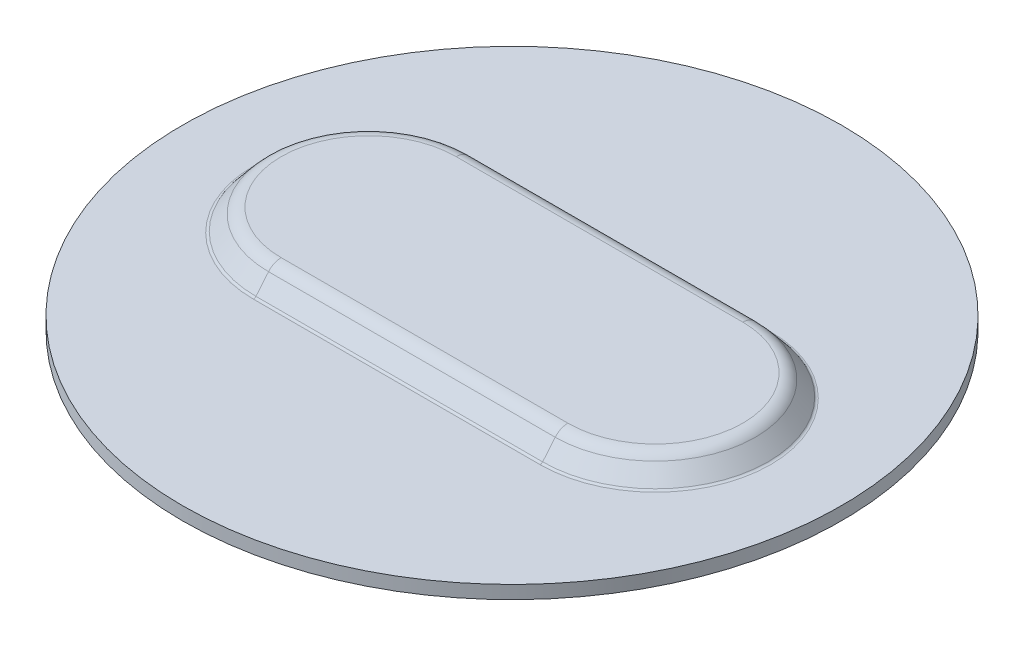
ISO-10303-21;
HEADER;
FILE_DESCRIPTION(('STEP AP214'),'2;1');
FILE_NAME('part.step','',(''),(''),'','','');
FILE_SCHEMA(('AUTOMOTIVE_DESIGN { 1 0 10303 214 1 1 1 1 }'));
ENDSEC;
DATA;
#1=APPLICATION_CONTEXT('core data for automotive mechanical design processes');
#2=APPLICATION_PROTOCOL_DEFINITION('international standard','automotive_design',2000,#1);
#3=PRODUCT_CONTEXT('',#1,'mechanical');
#4=PRODUCT('Part','Part','',(#3));
#5=PRODUCT_RELATED_PRODUCT_CATEGORY('part','',(#4));
#6=PRODUCT_DEFINITION_FORMATION('','',#4);
#7=PRODUCT_DEFINITION_CONTEXT('part definition',#1,'design');
#8=PRODUCT_DEFINITION('design','',#6,#7);
#9=PRODUCT_DEFINITION_SHAPE('','',#8);
#10=(LENGTH_UNIT() NAMED_UNIT(*) SI_UNIT(.MILLI.,.METRE.));
#11=(NAMED_UNIT(*) PLANE_ANGLE_UNIT() SI_UNIT($,.RADIAN.));
#12=(NAMED_UNIT(*) SI_UNIT($,.STERADIAN.) SOLID_ANGLE_UNIT());
#13=UNCERTAINTY_MEASURE_WITH_UNIT(LENGTH_MEASURE(1.E-05),#10,'distance_accuracy_value','');
#14=(GEOMETRIC_REPRESENTATION_CONTEXT(3) GLOBAL_UNCERTAINTY_ASSIGNED_CONTEXT((#13)) GLOBAL_UNIT_ASSIGNED_CONTEXT((#10,
#11,#12)) REPRESENTATION_CONTEXT('',''));
#15=CARTESIAN_POINT('',(0.,0.,0.));
#16=DIRECTION('',(0.,0.,1.));
#17=DIRECTION('',(1.,0.,0.));
#18=AXIS2_PLACEMENT_3D('',#15,#16,#17);
#19=CARTESIAN_POINT('',(-11.049,1.7018,0.));
#20=DIRECTION('',(0.,1.,0.));
#21=DIRECTION('',(0.,0.,1.));
#22=AXIS2_PLACEMENT_3D('',#19,#20,#21);
#23=PLANE('',#22);
#24=CARTESIAN_POINT('',(-11.049,1.7018,0.));
#25=DIRECTION('',(0.,-1.,0.));
#26=DIRECTION('',(0.,0.,1.));
#27=AXIS2_PLACEMENT_3D('',#24,#25,#26);
#28=CIRCLE('',#27,6.74280952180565);
#29=CARTESIAN_POINT('',(-11.049,1.7018,6.74280952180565));
#30=VERTEX_POINT('',#29);
#31=CARTESIAN_POINT('',(-11.049,1.7018,-6.74280952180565));
#32=VERTEX_POINT('',#31);
#33=EDGE_CURVE('E97',#30,#32,#28,.T.);
#34=ORIENTED_EDGE('',*,*,#33,.F.);
#35=DIRECTION('',(1.,0.,0.));
#36=VECTOR('',#35,1.);
#37=CARTESIAN_POINT('',(-11.049,1.7018,6.74280952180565));
#38=LINE('',#37,#36);
#39=CARTESIAN_POINT('',(11.049,1.7018,6.74280952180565));
#40=VERTEX_POINT('',#39);
#41=EDGE_CURVE('E95',#40,#30,#38,.F.);
#42=ORIENTED_EDGE('',*,*,#41,.F.);
#43=CARTESIAN_POINT('',(11.049,1.7018,0.));
#44=DIRECTION('',(0.,-1.,0.));
#45=DIRECTION('',(0.,0.,-1.));
#46=AXIS2_PLACEMENT_3D('',#43,#44,#45);
#47=CIRCLE('',#46,6.74280952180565);
#48=CARTESIAN_POINT('',(11.049,1.7018,-6.74280952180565));
#49=VERTEX_POINT('',#48);
#50=EDGE_CURVE('E80',#49,#40,#47,.T.);
#51=ORIENTED_EDGE('',*,*,#50,.F.);
#52=DIRECTION('',(-1.,0.,0.));
#53=VECTOR('',#52,1.);
#54=CARTESIAN_POINT('',(-11.049,1.7018,-6.74280952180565));
#55=LINE('',#54,#53);
#56=EDGE_CURVE('E152',#32,#49,#55,.F.);
#57=ORIENTED_EDGE('',*,*,#56,.F.);
#58=EDGE_LOOP('',(#34,#42,#51,#57));
#59=FACE_BOUND('',#58,.T.);
#60=ADVANCED_FACE('F18',(#59),#23,.T.);
#61=CARTESIAN_POINT('',(11.049,0.4318,0.));
#62=DIRECTION('',(0.,1.,0.));
#63=DIRECTION('',(0.,0.,1.));
#64=AXIS2_PLACEMENT_3D('',#61,#62,#63);
#65=TOROIDAL_SURFACE('',#64,6.74280952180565,1.27);
#66=CARTESIAN_POINT('',(11.049,0.4318,-6.74280952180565));
#67=DIRECTION('',(-1.,0.,0.));
#68=DIRECTION('',(0.,0.,1.));
#69=AXIS2_PLACEMENT_3D('',#66,#67,#68);
#70=CIRCLE('',#69,1.27);
#71=CARTESIAN_POINT('',(11.049,1.24814026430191,-7.71568596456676));
#72=VERTEX_POINT('',#71);
#73=EDGE_CURVE('E88',#49,#72,#70,.T.);
#74=ORIENTED_EDGE('',*,*,#73,.F.);
#75=ORIENTED_EDGE('',*,*,#50,.T.);
#76=CARTESIAN_POINT('',(11.049,0.4318,6.74280952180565));
#77=DIRECTION('',(1.,0.,0.));
#78=DIRECTION('',(0.,0.,-1.));
#79=AXIS2_PLACEMENT_3D('',#76,#77,#78);
#80=CIRCLE('',#79,1.27);
#81=CARTESIAN_POINT('',(11.049,1.24814026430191,7.71568596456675));
#82=VERTEX_POINT('',#81);
#83=EDGE_CURVE('E85',#82,#40,#80,.F.);
#84=ORIENTED_EDGE('',*,*,#83,.F.);
#85=CARTESIAN_POINT('',(11.049,1.24814026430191,0.));
#86=DIRECTION('',(0.,-1.,0.));
#87=DIRECTION('',(0.,0.,-1.));
#88=AXIS2_PLACEMENT_3D('',#85,#86,#87);
#89=CIRCLE('',#88,7.71568596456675);
#90=EDGE_CURVE('E102',#72,#82,#89,.T.);
#91=ORIENTED_EDGE('',*,*,#90,.F.);
#92=EDGE_LOOP('',(#74,#75,#84,#91));
#93=FACE_BOUND('',#92,.T.);
#94=ADVANCED_FACE('F83',(#93),#65,.T.);
#95=CARTESIAN_POINT('',(-11.049,0.4318,-6.74280952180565));
#96=DIRECTION('',(-1.,0.,0.));
#97=DIRECTION('',(0.,0.,1.));
#98=AXIS2_PLACEMENT_3D('',#95,#96,#97);
#99=CYLINDRICAL_SURFACE('',#98,1.27);
#100=CARTESIAN_POINT('',(-11.049,0.4318,-6.74280952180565));
#101=DIRECTION('',(-1.,0.,0.));
#102=DIRECTION('',(0.,0.,-1.));
#103=AXIS2_PLACEMENT_3D('',#100,#101,#102);
#104=CIRCLE('',#103,1.27);
#105=CARTESIAN_POINT('',(-11.049,1.24814026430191,-7.71568596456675));
#106=VERTEX_POINT('',#105);
#107=EDGE_CURVE('E111',#32,#106,#104,.T.);
#108=ORIENTED_EDGE('',*,*,#107,.F.);
#109=ORIENTED_EDGE('',*,*,#56,.T.);
#110=ORIENTED_EDGE('',*,*,#73,.T.);
#111=DIRECTION('',(1.,0.,0.));
#112=VECTOR('',#111,1.);
#113=CARTESIAN_POINT('',(-11.049,1.24814026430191,-7.71568596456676));
#114=LINE('',#113,#112);
#115=EDGE_CURVE('E314',#106,#72,#114,.T.);
#116=ORIENTED_EDGE('',*,*,#115,.F.);
#117=EDGE_LOOP('',(#108,#109,#110,#116));
#118=FACE_BOUND('',#117,.T.);
#119=ADVANCED_FACE('F137',(#118),#99,.T.);
#120=CARTESIAN_POINT('',(-11.049,0.4318,0.));
#121=DIRECTION('',(0.,1.,0.));
#122=DIRECTION('',(0.,0.,1.));
#123=AXIS2_PLACEMENT_3D('',#120,#121,#122);
#124=TOROIDAL_SURFACE('',#123,6.74280952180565,1.27);
#125=ORIENTED_EDGE('',*,*,#107,.T.);
#126=CARTESIAN_POINT('',(-11.049,1.24814026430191,0.));
#127=DIRECTION('',(0.,-1.,0.));
#128=DIRECTION('',(0.,0.,1.));
#129=AXIS2_PLACEMENT_3D('',#126,#127,#128);
#130=CIRCLE('',#129,7.71568596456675);
#131=CARTESIAN_POINT('',(-11.049,1.24814026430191,7.71568596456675));
#132=VERTEX_POINT('',#131);
#133=EDGE_CURVE('E119',#132,#106,#130,.T.);
#134=ORIENTED_EDGE('',*,*,#133,.F.);
#135=CARTESIAN_POINT('',(-11.049,0.4318,6.74280952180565));
#136=DIRECTION('',(1.,0.,0.));
#137=DIRECTION('',(0.,0.,-1.));
#138=AXIS2_PLACEMENT_3D('',#135,#136,#137);
#139=CIRCLE('',#138,1.27);
#140=EDGE_CURVE('E109',#30,#132,#139,.T.);
#141=ORIENTED_EDGE('',*,*,#140,.F.);
#142=ORIENTED_EDGE('',*,*,#33,.T.);
#143=EDGE_LOOP('',(#125,#134,#141,#142));
#144=FACE_BOUND('',#143,.T.);
#145=ADVANCED_FACE('F132',(#144),#124,.T.);
#146=CARTESIAN_POINT('',(-11.049,0.4318,6.74280952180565));
#147=DIRECTION('',(1.,0.,0.));
#148=DIRECTION('',(0.,0.,-1.));
#149=AXIS2_PLACEMENT_3D('',#146,#147,#148);
#150=CYLINDRICAL_SURFACE('',#149,1.27);
#151=ORIENTED_EDGE('',*,*,#83,.T.);
#152=ORIENTED_EDGE('',*,*,#41,.T.);
#153=ORIENTED_EDGE('',*,*,#140,.T.);
#154=DIRECTION('',(1.,0.,0.));
#155=VECTOR('',#154,1.);
#156=CARTESIAN_POINT('',(-11.049,1.24814026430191,7.71568596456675));
#157=LINE('',#156,#155);
#158=EDGE_CURVE('E107',#82,#132,#157,.F.);
#159=ORIENTED_EDGE('',*,*,#158,.F.);
#160=EDGE_LOOP('',(#151,#152,#153,#159));
#161=FACE_BOUND('',#160,.T.);
#162=ADVANCED_FACE('F105',(#161),#150,.T.);
#163=CARTESIAN_POINT('',(11.049,0.0907319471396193,0.));
#164=DIRECTION('',(0.,-1.,0.));
#165=DIRECTION('',(0.,0.,-1.));
#166=AXIS2_PLACEMENT_3D('',#163,#164,#165);
#167=CONICAL_SURFACE('',#166,8.68686685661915,0.698131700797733);
#168=DIRECTION('',(0.,0.766044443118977,0.64278760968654));
#169=VECTOR('',#168,1.);
#170=CARTESIAN_POINT('',(11.049,0.,-8.763));
#171=LINE('',#170,#169);
#172=CARTESIAN_POINT('',(11.049,0.0907319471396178,-8.68686685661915));
#173=VERTEX_POINT('',#172);
#174=EDGE_CURVE('E317',#72,#173,#171,.F.);
#175=ORIENTED_EDGE('',*,*,#174,.F.);
#176=ORIENTED_EDGE('',*,*,#90,.T.);
#177=DIRECTION('',(0.,-0.766044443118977,0.64278760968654));
#178=VECTOR('',#177,1.);
#179=CARTESIAN_POINT('',(11.049,0.,8.763));
#180=LINE('',#179,#178);
#181=CARTESIAN_POINT('',(11.049,0.0907319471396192,8.68686685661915));
#182=VERTEX_POINT('',#181);
#183=EDGE_CURVE('E298',#182,#82,#180,.F.);
#184=ORIENTED_EDGE('',*,*,#183,.F.);
#185=CARTESIAN_POINT('',(11.049,0.0907319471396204,0.));
#186=DIRECTION('',(0.,-1.,0.));
#187=DIRECTION('',(0.,0.,-1.));
#188=AXIS2_PLACEMENT_3D('',#185,#186,#187);
#189=CIRCLE('',#188,8.68686685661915);
#190=EDGE_CURVE('E285',#182,#173,#189,.F.);
#191=ORIENTED_EDGE('',*,*,#190,.T.);
#192=EDGE_LOOP('',(#175,#176,#184,#191));
#193=FACE_BOUND('',#192,.T.);
#194=ADVANCED_FACE('F330',(#193),#167,.T.);
#195=CARTESIAN_POINT('',(-11.049,0.,-8.763));
#196=DIRECTION('',(0.,0.64278760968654,-0.766044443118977));
#197=DIRECTION('',(0.,0.766044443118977,0.64278760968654));
#198=AXIS2_PLACEMENT_3D('',#195,#196,#197);
#199=PLANE('',#198);
#200=DIRECTION('',(0.,0.766044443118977,0.642787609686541));
#201=VECTOR('',#200,1.);
#202=CARTESIAN_POINT('',(-11.049,0.,-8.763));
#203=LINE('',#202,#201);
#204=CARTESIAN_POINT('',(-11.049,0.0907319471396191,-8.68686685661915));
#205=VERTEX_POINT('',#204);
#206=EDGE_CURVE('E123',#106,#205,#203,.F.);
#207=ORIENTED_EDGE('',*,*,#206,.F.);
#208=ORIENTED_EDGE('',*,*,#115,.T.);
#209=ORIENTED_EDGE('',*,*,#174,.T.);
#210=DIRECTION('',(-1.,0.,0.));
#211=VECTOR('',#210,1.);
#212=CARTESIAN_POINT('',(-11.049,0.0907319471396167,-8.68686685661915));
#213=LINE('',#212,#211);
#214=EDGE_CURVE('E269',#173,#205,#213,.T.);
#215=ORIENTED_EDGE('',*,*,#214,.T.);
#216=EDGE_LOOP('',(#207,#208,#209,#215));
#217=FACE_BOUND('',#216,.T.);
#218=ADVANCED_FACE('F335',(#217),#199,.T.);
#219=CARTESIAN_POINT('',(-11.049,0.090731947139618,0.));
#220=DIRECTION('',(0.,-1.,0.));
#221=DIRECTION('',(0.,0.,-1.));
#222=AXIS2_PLACEMENT_3D('',#219,#220,#221);
#223=CONICAL_SURFACE('',#222,8.68686685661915,0.698131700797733);
#224=DIRECTION('',(0.,-0.766044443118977,0.64278760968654));
#225=VECTOR('',#224,1.);
#226=CARTESIAN_POINT('',(-11.049,0.,8.763));
#227=LINE('',#226,#225);
#228=CARTESIAN_POINT('',(-11.049,0.0907319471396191,8.68686685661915));
#229=VERTEX_POINT('',#228);
#230=EDGE_CURVE('E122',#132,#229,#227,.T.);
#231=ORIENTED_EDGE('',*,*,#230,.F.);
#232=ORIENTED_EDGE('',*,*,#133,.T.);
#233=ORIENTED_EDGE('',*,*,#206,.T.);
#234=CARTESIAN_POINT('',(-11.049,0.0907319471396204,0.));
#235=DIRECTION('',(0.,-1.,0.));
#236=DIRECTION('',(0.,0.,-1.));
#237=AXIS2_PLACEMENT_3D('',#234,#235,#236);
#238=CIRCLE('',#237,8.68686685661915);
#239=EDGE_CURVE('E263',#205,#229,#238,.F.);
#240=ORIENTED_EDGE('',*,*,#239,.T.);
#241=EDGE_LOOP('',(#231,#232,#233,#240));
#242=FACE_BOUND('',#241,.T.);
#243=ADVANCED_FACE('F342',(#242),#223,.T.);
#244=CARTESIAN_POINT('',(-11.049,0.,8.763));
#245=DIRECTION('',(0.,0.64278760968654,0.766044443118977));
#246=DIRECTION('',(0.,-0.766044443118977,0.64278760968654));
#247=AXIS2_PLACEMENT_3D('',#244,#245,#246);
#248=PLANE('',#247);
#249=ORIENTED_EDGE('',*,*,#183,.T.);
#250=ORIENTED_EDGE('',*,*,#158,.T.);
#251=ORIENTED_EDGE('',*,*,#230,.T.);
#252=DIRECTION('',(1.,0.,0.));
#253=VECTOR('',#252,1.);
#254=CARTESIAN_POINT('',(-11.049,0.0907319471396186,8.68686685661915));
#255=LINE('',#254,#253);
#256=EDGE_CURVE('E236',#229,#182,#255,.T.);
#257=ORIENTED_EDGE('',*,*,#256,.T.);
#258=EDGE_LOOP('',(#249,#250,#251,#257));
#259=FACE_BOUND('',#258,.T.);
#260=ADVANCED_FACE('F279',(#259),#248,.T.);
#261=CARTESIAN_POINT('',(11.049,0.254,0.));
#262=DIRECTION('',(0.,-1.,0.));
#263=DIRECTION('',(0.,0.,-1.));
#264=AXIS2_PLACEMENT_3D('',#261,#262,#263);
#265=TOROIDAL_SURFACE('',#264,8.88144214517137,0.254);
#266=CARTESIAN_POINT('',(11.049,0.,0.));
#267=DIRECTION('',(0.,1.,0.));
#268=DIRECTION('',(0.,0.,1.));
#269=AXIS2_PLACEMENT_3D('',#266,#267,#268);
#270=CIRCLE('',#269,8.88144214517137);
#271=CARTESIAN_POINT('',(11.049,0.,8.88144214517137));
#272=VERTEX_POINT('',#271);
#273=CARTESIAN_POINT('',(11.049,0.,-8.88144214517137));
#274=VERTEX_POINT('',#273);
#275=EDGE_CURVE('E231',#272,#274,#270,.T.);
#276=ORIENTED_EDGE('',*,*,#275,.T.);
#277=CARTESIAN_POINT('',(11.049,0.254,-8.88144214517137));
#278=DIRECTION('',(-1.,0.,0.));
#279=DIRECTION('',(0.,0.,1.));
#280=AXIS2_PLACEMENT_3D('',#277,#278,#279);
#281=CIRCLE('',#280,0.254000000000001);
#282=EDGE_CURVE('E266',#274,#173,#281,.T.);
#283=ORIENTED_EDGE('',*,*,#282,.T.);
#284=ORIENTED_EDGE('',*,*,#190,.F.);
#285=CARTESIAN_POINT('',(11.049,0.254,8.88144214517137));
#286=DIRECTION('',(1.,0.,0.));
#287=DIRECTION('',(0.,0.,-1.));
#288=AXIS2_PLACEMENT_3D('',#285,#286,#287);
#289=CIRCLE('',#288,0.254000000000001);
#290=EDGE_CURVE('E240',#182,#272,#289,.F.);
#291=ORIENTED_EDGE('',*,*,#290,.T.);
#292=EDGE_LOOP('',(#276,#283,#284,#291));
#293=FACE_BOUND('',#292,.T.);
#294=ADVANCED_FACE('F275',(#293),#265,.F.);
#295=CARTESIAN_POINT('',(-11.049,0.254,-8.88144214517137));
#296=DIRECTION('',(-1.,0.,0.));
#297=DIRECTION('',(0.,0.,1.));
#298=AXIS2_PLACEMENT_3D('',#295,#296,#297);
#299=CYLINDRICAL_SURFACE('',#298,0.254000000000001);
#300=DIRECTION('',(1.,0.,0.));
#301=VECTOR('',#300,1.);
#302=CARTESIAN_POINT('',(0.,0.,-8.88144214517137));
#303=LINE('',#302,#301);
#304=CARTESIAN_POINT('',(-11.049,0.,-8.88144214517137));
#305=VERTEX_POINT('',#304);
#306=EDGE_CURVE('E229',#274,#305,#303,.F.);
#307=ORIENTED_EDGE('',*,*,#306,.T.);
#308=CARTESIAN_POINT('',(-11.049,0.254,-8.88144214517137));
#309=DIRECTION('',(1.,0.,0.));
#310=DIRECTION('',(0.,0.,-1.));
#311=AXIS2_PLACEMENT_3D('',#308,#309,#310);
#312=CIRCLE('',#311,0.254);
#313=EDGE_CURVE('E237',#305,#205,#312,.F.);
#314=ORIENTED_EDGE('',*,*,#313,.T.);
#315=ORIENTED_EDGE('',*,*,#214,.F.);
#316=ORIENTED_EDGE('',*,*,#282,.F.);
#317=EDGE_LOOP('',(#307,#314,#315,#316));
#318=FACE_BOUND('',#317,.T.);
#319=ADVANCED_FACE('F251',(#318),#299,.F.);
#320=CARTESIAN_POINT('',(-11.049,0.254,0.));
#321=DIRECTION('',(0.,-1.,0.));
#322=DIRECTION('',(0.,0.,-1.));
#323=AXIS2_PLACEMENT_3D('',#320,#321,#322);
#324=TOROIDAL_SURFACE('',#323,8.88144214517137,0.254);
#325=CARTESIAN_POINT('',(-11.049,0.,0.));
#326=DIRECTION('',(0.,1.,0.));
#327=DIRECTION('',(0.,0.,-1.));
#328=AXIS2_PLACEMENT_3D('',#325,#326,#327);
#329=CIRCLE('',#328,8.88144214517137);
#330=CARTESIAN_POINT('',(-11.049,0.,8.88144214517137));
#331=VERTEX_POINT('',#330);
#332=EDGE_CURVE('E35',#305,#331,#329,.T.);
#333=ORIENTED_EDGE('',*,*,#332,.T.);
#334=CARTESIAN_POINT('',(-11.049,0.254,8.88144214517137));
#335=DIRECTION('',(1.,0.,0.));
#336=DIRECTION('',(0.,0.,-1.));
#337=AXIS2_PLACEMENT_3D('',#334,#335,#336);
#338=CIRCLE('',#337,0.254000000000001);
#339=EDGE_CURVE('E234',#331,#229,#338,.T.);
#340=ORIENTED_EDGE('',*,*,#339,.T.);
#341=ORIENTED_EDGE('',*,*,#239,.F.);
#342=ORIENTED_EDGE('',*,*,#313,.F.);
#343=EDGE_LOOP('',(#333,#340,#341,#342));
#344=FACE_BOUND('',#343,.T.);
#345=ADVANCED_FACE('F247',(#344),#324,.F.);
#346=CARTESIAN_POINT('',(-11.049,0.254,8.88144214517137));
#347=DIRECTION('',(1.,0.,0.));
#348=DIRECTION('',(0.,0.,-1.));
#349=AXIS2_PLACEMENT_3D('',#346,#347,#348);
#350=CYLINDRICAL_SURFACE('',#349,0.254000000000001);
#351=ORIENTED_EDGE('',*,*,#256,.F.);
#352=ORIENTED_EDGE('',*,*,#339,.F.);
#353=DIRECTION('',(1.,0.,0.));
#354=VECTOR('',#353,1.);
#355=CARTESIAN_POINT('',(0.,0.,8.88144214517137));
#356=LINE('',#355,#354);
#357=EDGE_CURVE('E219',#331,#272,#356,.T.);
#358=ORIENTED_EDGE('',*,*,#357,.T.);
#359=ORIENTED_EDGE('',*,*,#290,.F.);
#360=EDGE_LOOP('',(#351,#352,#358,#359));
#361=FACE_BOUND('',#360,.T.);
#362=ADVANCED_FACE('F206',(#361),#350,.F.);
#363=CARTESIAN_POINT('',(0.,0.,0.));
#364=DIRECTION('',(0.,-1.,0.));
#365=DIRECTION('',(0.,0.,-1.));
#366=AXIS2_PLACEMENT_3D('',#363,#364,#365);
#367=PLANE('',#366);
#368=CARTESIAN_POINT('',(0.,0.,0.));
#369=DIRECTION('',(0.,1.,0.));
#370=DIRECTION('',(0.,0.,1.));
#371=AXIS2_PLACEMENT_3D('',#368,#369,#370);
#372=CIRCLE('',#371,25.4);
#373=CARTESIAN_POINT('',(0.,0.,25.4));
#374=VERTEX_POINT('',#373);
#375=EDGE_CURVE('E22',#374,#374,#372,.F.);
#376=ORIENTED_EDGE('',*,*,#375,.F.);
#377=EDGE_LOOP('',(#376));
#378=FACE_BOUND('',#377,.T.);
#379=ORIENTED_EDGE('',*,*,#332,.F.);
#380=ORIENTED_EDGE('',*,*,#306,.F.);
#381=ORIENTED_EDGE('',*,*,#275,.F.);
#382=ORIENTED_EDGE('',*,*,#357,.F.);
#383=EDGE_LOOP('',(#379,#380,#381,#382));
#384=FACE_BOUND('',#383,.T.);
#385=ADVANCED_FACE('F199',(#378,#384),#367,.F.);
#386=CARTESIAN_POINT('',(0.,-1.016,0.));
#387=DIRECTION('',(0.,1.,0.));
#388=DIRECTION('',(0.,0.,1.));
#389=AXIS2_PLACEMENT_3D('',#386,#387,#388);
#390=CYLINDRICAL_SURFACE('',#389,25.4);
#391=ORIENTED_EDGE('',*,*,#375,.T.);
#392=EDGE_LOOP('',(#391));
#393=FACE_BOUND('',#392,.T.);
#394=CARTESIAN_POINT('',(0.,-1.016,0.));
#395=DIRECTION('',(0.,1.,0.));
#396=DIRECTION('',(0.,0.,1.));
#397=AXIS2_PLACEMENT_3D('',#394,#395,#396);
#398=CIRCLE('',#397,25.4);
#399=CARTESIAN_POINT('',(0.,-1.016,25.4));
#400=VERTEX_POINT('',#399);
#401=EDGE_CURVE('E11',#400,#400,#398,.F.);
#402=ORIENTED_EDGE('',*,*,#401,.F.);
#403=EDGE_LOOP('',(#402));
#404=FACE_BOUND('',#403,.T.);
#405=ADVANCED_FACE('F193',(#393,#404),#390,.T.);
#406=CARTESIAN_POINT('',(0.,-1.016,0.));
#407=DIRECTION('',(0.,-1.,0.));
#408=DIRECTION('',(0.,0.,-1.));
#409=AXIS2_PLACEMENT_3D('',#406,#407,#408);
#410=PLANE('',#409);
#411=ORIENTED_EDGE('',*,*,#401,.T.);
#412=EDGE_LOOP('',(#411));
#413=FACE_BOUND('',#412,.T.);
#414=ADVANCED_FACE('F191',(#413),#410,.T.);
#415=CLOSED_SHELL('',(#60,#94,#119,#145,#162,#194,#218,#243,#260,#294,#319,#345,#362,#385,#405,#414));
#416=MANIFOLD_SOLID_BREP('B1',#415);
#417=ADVANCED_BREP_SHAPE_REPRESENTATION('',(#18,#416),#14);
#418=SHAPE_DEFINITION_REPRESENTATION(#9,#417);
ENDSEC;
END-ISO-10303-21;
